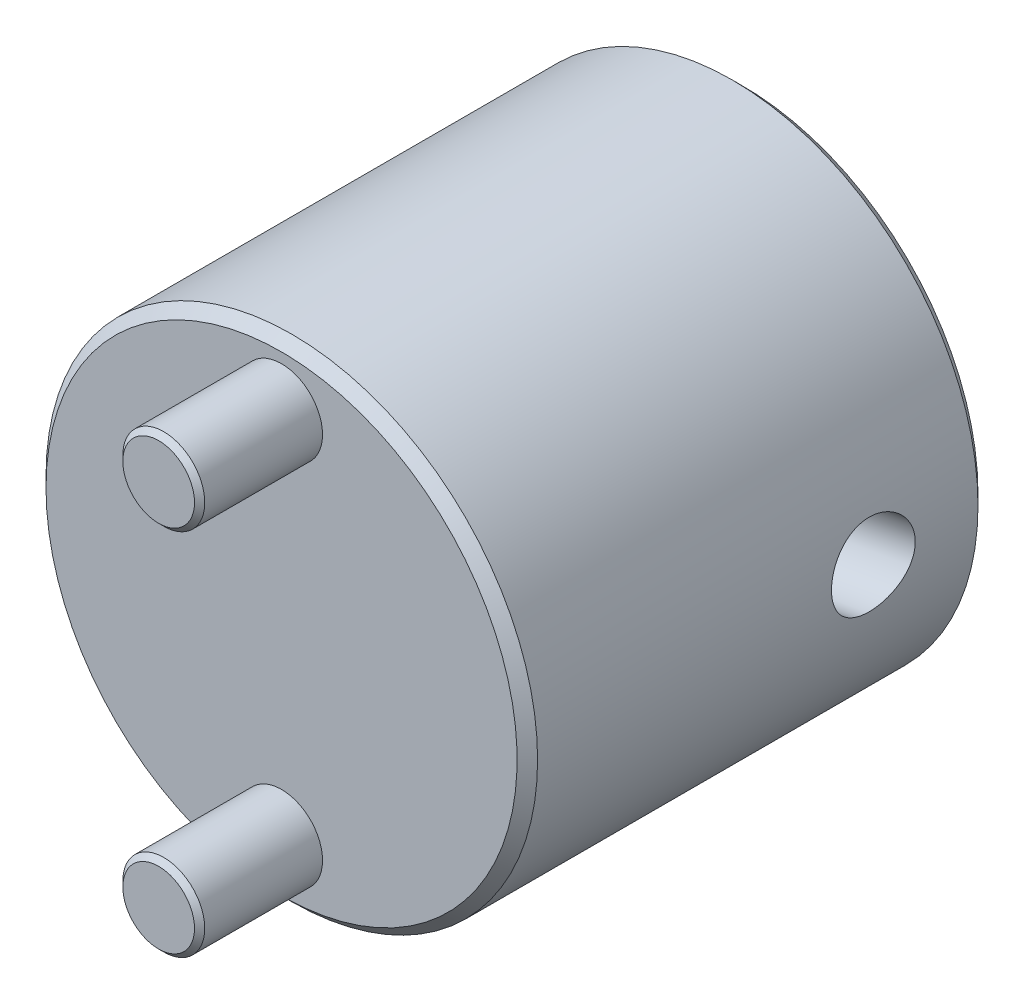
ISO-10303-21;
HEADER;
FILE_DESCRIPTION(('STEP AP214'),'2;1');
FILE_NAME('part.step','',(''),(''),'','','');
FILE_SCHEMA(('AUTOMOTIVE_DESIGN { 1 0 10303 214 1 1 1 1 }'));
ENDSEC;
DATA;
#1=APPLICATION_CONTEXT('core data for automotive mechanical design processes');
#2=APPLICATION_PROTOCOL_DEFINITION('international standard','automotive_design',2000,#1);
#3=PRODUCT_CONTEXT('',#1,'mechanical');
#4=PRODUCT('Part','Part','',(#3));
#5=PRODUCT_RELATED_PRODUCT_CATEGORY('part','',(#4));
#6=PRODUCT_DEFINITION_FORMATION('','',#4);
#7=PRODUCT_DEFINITION_CONTEXT('part definition',#1,'design');
#8=PRODUCT_DEFINITION('design','',#6,#7);
#9=PRODUCT_DEFINITION_SHAPE('','',#8);
#10=(LENGTH_UNIT() NAMED_UNIT(*) SI_UNIT(.MILLI.,.METRE.));
#11=(NAMED_UNIT(*) PLANE_ANGLE_UNIT() SI_UNIT($,.RADIAN.));
#12=(NAMED_UNIT(*) SI_UNIT($,.STERADIAN.) SOLID_ANGLE_UNIT());
#13=UNCERTAINTY_MEASURE_WITH_UNIT(LENGTH_MEASURE(1.E-05),#10,'distance_accuracy_value','');
#14=(GEOMETRIC_REPRESENTATION_CONTEXT(3) GLOBAL_UNCERTAINTY_ASSIGNED_CONTEXT((#13)) GLOBAL_UNIT_ASSIGNED_CONTEXT((#10,
#11,#12)) REPRESENTATION_CONTEXT('',''));
#15=CARTESIAN_POINT('',(0.,0.,0.));
#16=DIRECTION('',(0.,0.,1.));
#17=DIRECTION('',(1.,0.,0.));
#18=AXIS2_PLACEMENT_3D('',#15,#16,#17);
#19=CARTESIAN_POINT('',(0.,0.,12.));
#20=DIRECTION('',(0.,0.,1.));
#21=DIRECTION('',(1.,0.,0.));
#22=AXIS2_PLACEMENT_3D('',#19,#20,#21);
#23=PLANE('',#22);
#24=CARTESIAN_POINT('',(0.,18.,12.));
#25=DIRECTION('',(0.,0.,1.));
#26=DIRECTION('',(1.,0.,0.));
#27=AXIS2_PLACEMENT_3D('',#24,#25,#26);
#28=CIRCLE('',#27,3.50000030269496);
#29=CARTESIAN_POINT('',(3.50000030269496,18.,12.));
#30=VERTEX_POINT('',#29);
#31=EDGE_CURVE('E17',#30,#30,#28,.F.);
#32=ORIENTED_EDGE('',*,*,#31,.F.);
#33=EDGE_LOOP('',(#32));
#34=FACE_BOUND('',#33,.T.);
#35=ADVANCED_FACE('F14',(#34),#23,.T.);
#36=CARTESIAN_POINT('',(0.,0.,12.));
#37=DIRECTION('',(0.,0.,1.));
#38=DIRECTION('',(1.,0.,0.));
#39=AXIS2_PLACEMENT_3D('',#36,#37,#38);
#40=PLANE('',#39);
#41=CARTESIAN_POINT('',(0.,-18.,12.));
#42=DIRECTION('',(0.,0.,1.));
#43=DIRECTION('',(1.,0.,0.));
#44=AXIS2_PLACEMENT_3D('',#41,#42,#43);
#45=CIRCLE('',#44,3.50000030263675);
#46=CARTESIAN_POINT('',(3.50000030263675,-18.,12.));
#47=VERTEX_POINT('',#46);
#48=EDGE_CURVE('E121',#47,#47,#45,.F.);
#49=ORIENTED_EDGE('',*,*,#48,.F.);
#50=EDGE_LOOP('',(#49));
#51=FACE_BOUND('',#50,.T.);
#52=ADVANCED_FACE('F111',(#51),#40,.T.);
#53=CARTESIAN_POINT('',(2.796688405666,0.,-8.319464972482));
#54=DIRECTION('',(0.207911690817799,0.,0.978147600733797));
#55=DIRECTION('',(0.978147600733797,0.,-0.207911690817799));
#56=AXIS2_PLACEMENT_3D('',#53,#54,#55);
#57=PLANE('',#56);
#58=CARTESIAN_POINT('',(2.7966884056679,0.,-8.31946497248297));
#59=DIRECTION('',(0.207911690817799,0.,0.978147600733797));
#60=DIRECTION('',(0.978147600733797,0.,-0.207911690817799));
#61=AXIS2_PLACEMENT_3D('',#58,#59,#60);
#62=CIRCLE('',#61,12.5);
#63=CARTESIAN_POINT('',(15.0235334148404,0.,-10.9183611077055));
#64=VERTEX_POINT('',#63);
#65=EDGE_CURVE('E36',#64,#64,#62,.F.);
#66=ORIENTED_EDGE('',*,*,#65,.T.);
#67=EDGE_LOOP('',(#66));
#68=FACE_BOUND('',#67,.T.);
#69=ADVANCED_FACE('F108',(#68),#57,.F.);
#70=CARTESIAN_POINT('',(0.,18.,11.4999988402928));
#71=DIRECTION('',(0.,0.,-1.));
#72=DIRECTION('',(-1.,0.,0.));
#73=AXIS2_PLACEMENT_3D('',#70,#71,#72);
#74=CONICAL_SURFACE('',#73,4.00000150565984,0.785398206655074);
#75=CARTESIAN_POINT('',(0.,18.,11.49999733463));
#76=DIRECTION('',(0.,0.,1.));
#77=DIRECTION('',(1.,0.,0.));
#78=AXIS2_PLACEMENT_3D('',#75,#76,#77);
#79=CIRCLE('',#78,4.);
#80=CARTESIAN_POINT('',(4.,18.,11.49999733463));
#81=VERTEX_POINT('',#80);
#82=EDGE_CURVE('E33',#81,#81,#79,.F.);
#83=ORIENTED_EDGE('',*,*,#82,.F.);
#84=EDGE_LOOP('',(#83));
#85=FACE_BOUND('',#84,.T.);
#86=ORIENTED_EDGE('',*,*,#31,.T.);
#87=EDGE_LOOP('',(#86));
#88=FACE_BOUND('',#87,.T.);
#89=ADVANCED_FACE('F104',(#85,#88),#74,.T.);
#90=CARTESIAN_POINT('',(0.,-18.,11.4999988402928));
#91=DIRECTION('',(0.,0.,-1.));
#92=DIRECTION('',(-1.,0.,0.));
#93=AXIS2_PLACEMENT_3D('',#90,#91,#92);
#94=CONICAL_SURFACE('',#93,4.00000150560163,0.785398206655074);
#95=CARTESIAN_POINT('',(0.,-18.,11.49999733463));
#96=DIRECTION('',(0.,0.,1.));
#97=DIRECTION('',(1.,0.,0.));
#98=AXIS2_PLACEMENT_3D('',#95,#96,#97);
#99=CIRCLE('',#98,4.);
#100=CARTESIAN_POINT('',(4.,-18.,11.49999733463));
#101=VERTEX_POINT('',#100);
#102=EDGE_CURVE('E29',#101,#101,#99,.F.);
#103=ORIENTED_EDGE('',*,*,#102,.F.);
#104=EDGE_LOOP('',(#103));
#105=FACE_BOUND('',#104,.T.);
#106=ORIENTED_EDGE('',*,*,#48,.T.);
#107=EDGE_LOOP('',(#106));
#108=FACE_BOUND('',#107,.T.);
#109=ADVANCED_FACE('F99',(#105,#108),#94,.T.);
#110=CARTESIAN_POINT('',(-8.154293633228,0.,-59.83978480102));
#111=DIRECTION('',(0.207911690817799,0.,0.978147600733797));
#112=DIRECTION('',(0.978147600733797,0.,-0.207911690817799));
#113=AXIS2_PLACEMENT_3D('',#110,#111,#112);
#114=CYLINDRICAL_SURFACE('',#113,12.5);
#115=CARTESIAN_POINT('',(-4.9999999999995,0.,-45.));
#116=DIRECTION('',(0.,0.,-1.));
#117=DIRECTION('',(1.,0.,0.));
#118=AXIS2_PLACEMENT_3D('',#115,#116,#117);
#119=ELLIPSE('',#118,12.779257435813,12.5);
#120=CARTESIAN_POINT('',(7.77925743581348,0.,-45.));
#121=VERTEX_POINT('',#120);
#122=EDGE_CURVE('E32',#121,#121,#119,.F.);
#123=ORIENTED_EDGE('',*,*,#122,.F.);
#124=EDGE_LOOP('',(#123));
#125=FACE_BOUND('',#124,.T.);
#126=ORIENTED_EDGE('',*,*,#65,.F.);
#127=EDGE_LOOP('',(#126));
#128=FACE_BOUND('',#127,.T.);
#129=CARTESIAN_POINT('',(9.92969698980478,0.,-34.8829773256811));
#130=CARTESIAN_POINT('',(9.92969690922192,0.109267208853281,-34.8829771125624));
#131=CARTESIAN_POINT('',(9.92922387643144,0.21853734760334,-34.8782954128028));
#132=CARTESIAN_POINT('',(9.92736131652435,0.436308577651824,-34.8596159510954));
#133=CARTESIAN_POINT('',(9.92597143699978,0.544809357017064,-34.8456146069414));
#134=CARTESIAN_POINT('',(9.92235994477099,0.760358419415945,-34.8084095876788));
#135=CARTESIAN_POINT('',(9.92013725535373,0.86740463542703,-34.7851939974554));
#136=CARTESIAN_POINT('',(9.9150067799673,1.07914970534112,-34.7298047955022));
#137=CARTESIAN_POINT('',(9.91209872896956,1.18384763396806,-34.6976277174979));
#138=CARTESIAN_POINT('',(9.90264013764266,1.49277788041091,-34.5882675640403));
#139=CARTESIAN_POINT('',(9.89534102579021,1.69256281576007,-34.4981300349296));
#140=CARTESIAN_POINT('',(9.88078543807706,2.07458913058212,-34.2865883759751));
#141=CARTESIAN_POINT('',(9.87352895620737,2.25683304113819,-34.1651887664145));
#142=CARTESIAN_POINT('',(9.86139833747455,2.60472253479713,-33.8908933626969));
#143=CARTESIAN_POINT('',(9.85659987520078,2.76972880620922,-33.7371820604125));
#144=CARTESIAN_POINT('',(9.85271590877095,3.07283077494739,-33.4050774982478));
#145=CARTESIAN_POINT('',(9.85363183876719,3.21091970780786,-33.2266780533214));
#146=CARTESIAN_POINT('',(9.86431180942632,3.45978450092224,-32.8452206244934));
#147=CARTESIAN_POINT('',(9.87430614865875,3.56975347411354,-32.6416406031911));
#148=CARTESIAN_POINT('',(9.90625678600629,3.75402351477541,-32.2197999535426));
#149=CARTESIAN_POINT('',(9.92820969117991,3.82833468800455,-32.0015435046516));
#150=CARTESIAN_POINT('',(9.98491338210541,3.93682830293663,-31.5642283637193));
#151=CARTESIAN_POINT('',(10.0192407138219,3.97219740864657,-31.3454100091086));
#152=CARTESIAN_POINT('',(10.1008831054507,4.00551082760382,-30.9073735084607));
#153=CARTESIAN_POINT('',(10.1481945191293,4.00346563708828,-30.6881554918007));
#154=CARTESIAN_POINT('',(10.2520272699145,3.96293460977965,-30.2651699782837));
#155=CARTESIAN_POINT('',(10.3080824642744,3.92597140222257,-30.0611393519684));
#156=CARTESIAN_POINT('',(10.4280171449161,3.81912665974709,-29.6643226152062));
#157=CARTESIAN_POINT('',(10.4918975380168,3.74924130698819,-29.471537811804));
#158=CARTESIAN_POINT('',(10.6249382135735,3.5774893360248,-29.0988797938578));
#159=CARTESIAN_POINT('',(10.6941639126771,3.47515345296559,-28.9192469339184));
#160=CARTESIAN_POINT('',(10.8328650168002,3.2417276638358,-28.5798524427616));
#161=CARTESIAN_POINT('',(10.902340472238,3.11063158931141,-28.4200950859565));
#162=CARTESIAN_POINT('',(11.0404671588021,2.81604951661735,-28.1164255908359));
#163=CARTESIAN_POINT('',(11.1089208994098,2.65131653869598,-27.973633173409));
#164=CARTESIAN_POINT('',(11.2366389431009,2.29773509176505,-27.7161763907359));
#165=CARTESIAN_POINT('',(11.2958992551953,2.10887621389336,-27.6015242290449));
#166=CARTESIAN_POINT('',(11.3747770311,1.8105187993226,-27.4524296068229));
#167=CARTESIAN_POINT('',(11.399501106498,1.70799133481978,-27.4063695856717));
#168=CARTESIAN_POINT('',(11.4449940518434,1.49879447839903,-27.3224696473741));
#169=CARTESIAN_POINT('',(11.4657645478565,1.39212681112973,-27.2846263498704));
#170=CARTESIAN_POINT('',(11.502891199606,1.17558171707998,-27.2174964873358));
#171=CARTESIAN_POINT('',(11.5192543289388,1.0657096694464,-27.1881963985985));
#172=CARTESIAN_POINT('',(11.5472587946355,0.843458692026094,-27.1383139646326));
#173=CARTESIAN_POINT('',(11.5589022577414,0.731080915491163,-27.1177276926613));
#174=CARTESIAN_POINT('',(11.5763222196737,0.515800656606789,-27.0870197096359));
#175=CARTESIAN_POINT('',(11.5825630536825,0.413053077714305,-27.0760680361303));
#176=CARTESIAN_POINT('',(11.5908972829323,0.206871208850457,-27.0614563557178));
#177=CARTESIAN_POINT('',(11.5929906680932,0.103436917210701,-27.0577963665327));
#178=CARTESIAN_POINT('',(11.5929903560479,-0.109267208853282,-27.0577966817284));
#179=CARTESIAN_POINT('',(11.5906540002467,-0.21853734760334,-27.0618812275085));
#180=CARTESIAN_POINT('',(11.5813548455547,-0.436308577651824,-27.0781881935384));
#181=CARTESIAN_POINT('',(11.5743902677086,-0.544809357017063,-27.0904137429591));
#182=CARTESIAN_POINT('',(11.5559583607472,-0.760358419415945,-27.1229332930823));
#183=CARTESIAN_POINT('',(11.5444852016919,-0.867404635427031,-27.1432377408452));
#184=CARTESIAN_POINT('',(11.5172694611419,-1.07914970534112,-27.1917515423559));
#185=CARTESIAN_POINT('',(11.5015252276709,-1.18384763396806,-27.2199639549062));
#186=CARTESIAN_POINT('',(11.4484035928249,-1.4927778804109,-27.31602227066));
#187=CARTESIAN_POINT('',(11.4050732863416,-1.69256281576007,-27.3953981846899));
#188=CARTESIAN_POINT('',(11.3057343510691,-2.07458913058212,-27.5827308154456));
#189=CARTESIAN_POINT('',(11.2497275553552,-2.25683304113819,-27.690683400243));
#190=CARTESIAN_POINT('',(11.1270796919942,-2.60472253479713,-27.9363307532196));
#191=CARTESIAN_POINT('',(11.0601760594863,-2.76972880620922,-28.0748013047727));
#192=CARTESIAN_POINT('',(10.9215487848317,-3.07283077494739,-28.3766141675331));
#193=CARTESIAN_POINT('',(10.8498239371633,-3.21091970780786,-28.5399627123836));
#194=CARTESIAN_POINT('',(10.7044278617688,-3.45978450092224,-28.8927853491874));
#195=CARTESIAN_POINT('',(10.630754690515,-3.56975347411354,-29.0828300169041));
#196=CARTESIAN_POINT('',(10.4883650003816,-3.75402351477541,-29.4811961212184));
#197=CARTESIAN_POINT('',(10.4196470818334,-3.82833468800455,-29.68951235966));
#198=CARTESIAN_POINT('',(10.293576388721,-3.93682830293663,-30.112083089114));
#199=CARTESIAN_POINT('',(10.2359345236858,-3.97219740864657,-30.3259457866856));
#200=CARTESIAN_POINT('',(10.1323530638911,-4.00551082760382,-30.759318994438));
#201=CARTESIAN_POINT('',(10.0864101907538,-4.00346563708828,-30.9788279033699));
#202=CARTESIAN_POINT('',(10.0092224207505,-3.96293460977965,-31.4074769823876));
#203=CARTESIAN_POINT('',(9.97744465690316,-3.92597140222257,-31.6166679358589));
#204=CARTESIAN_POINT('',(9.92561053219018,-3.81912665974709,-32.0279598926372));
#205=CARTESIAN_POINT('',(9.90555553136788,-3.74924130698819,-32.2300600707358));
#206=CARTESIAN_POINT('',(9.87552056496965,-3.5774893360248,-32.6246126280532));
#207=CARTESIAN_POINT('',(9.86569812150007,-3.47515345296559,-32.8168720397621));
#208=CARTESIAN_POINT('',(9.85436370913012,-3.2417276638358,-33.1833391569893));
#209=CARTESIAN_POINT('',(9.85285352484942,-3.11063158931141,-33.3575429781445));
#210=CARTESIAN_POINT('',(9.85552502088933,-2.81604951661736,-33.6911400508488));
#211=CARTESIAN_POINT('',(9.85998171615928,-2.65131653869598,-33.8494300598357));
#212=CARTESIAN_POINT('',(9.87194084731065,-2.29773509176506,-34.1365761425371));
#213=CARTESIAN_POINT('',(9.87944460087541,-2.10887621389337,-34.2654194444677));
#214=CARTESIAN_POINT('',(9.89086078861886,-1.81051879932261,-34.4337066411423));
#215=CARTESIAN_POINT('',(9.89471305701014,-1.70799133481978,-34.4858407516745));
#216=CARTESIAN_POINT('',(9.90214775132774,-1.49879447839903,-34.5809908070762));
#217=CARTESIAN_POINT('',(9.90573028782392,-1.39212681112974,-34.6240105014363));
#218=CARTESIAN_POINT('',(9.91234299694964,-1.17558171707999,-34.7004374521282));
#219=CARTESIAN_POINT('',(9.91537403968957,-1.06570966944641,-34.7338598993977));
#220=CARTESIAN_POINT('',(9.92066837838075,-0.843458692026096,-34.790820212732));
#221=CARTESIAN_POINT('',(9.92293202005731,-0.731080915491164,-34.8143625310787));
#222=CARTESIAN_POINT('',(9.92635588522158,-0.51580065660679,-34.8495010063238));
#223=CARTESIAN_POINT('',(9.92760272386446,-0.413053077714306,-34.8620442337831));
#224=CARTESIAN_POINT('',(9.92927331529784,-0.206871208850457,-34.8787825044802));
#225=CARTESIAN_POINT('',(9.92969706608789,-0.103436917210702,-34.8829775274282));
#226=CARTESIAN_POINT('',(9.92969698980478,0.,-34.8829773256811));
#227=B_SPLINE_CURVE_WITH_KNOTS('',3,(#129,#130,#131,#132,#133,#134,#135,#136,#137,#138,#139,
#140,#141,#142,#143,#144,#145,#146,#147,#148,#149,#150,#151,#152,#153,#154,#155,#156,#157,#158,
#159,#160,#161,#162,#163,#164,#165,#166,#167,#168,#169,#170,#171,#172,#173,#174,#175,#176,#177,
#178,#179,#180,#181,#182,#183,#184,#185,#186,#187,#188,#189,#190,#191,#192,#193,#194,#195,#196,
#197,#198,#199,#200,#201,#202,#203,#204,#205,#206,#207,#208,#209,#210,#211,#212,#213,#214,#215,
#216,#217,#218,#219,#220,#221,#222,#223,#224,#225,#226),.UNSPECIFIED.,.T.,.F.,(4,2,2,2,2,2,2,2,
2,2,2,2,2,2,2,2,2,2,2,2,2,2,2,2,2,2,2,2,2,2,2,2,2,2,2,2,2,2,2,2,2,2,2,2,2,2,2,2,4),(0.,
0.327705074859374,0.655536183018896,0.983792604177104,1.31217617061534,1.96678919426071,
2.62130761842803,3.29492000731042,3.96870146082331,4.66006760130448,5.35123768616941,
6.0207071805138,6.68998886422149,7.33137068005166,7.97282689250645,8.62401811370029,
9.27534913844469,9.95775723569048,10.6404607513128,10.9853574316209,11.3301119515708,
11.6743177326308,12.0183682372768,12.3285868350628,12.6388061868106,12.9665112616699,
13.2943423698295,13.6225987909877,13.9509823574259,14.6055953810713,15.2601138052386,
15.933726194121,16.6075076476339,17.298873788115,17.99004387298,18.6595133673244,
19.3287950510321,19.9701768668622,20.611633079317,21.2628243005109,21.9141553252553,
22.596563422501,23.2792669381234,23.6241636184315,23.9689181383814,24.3131239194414,
24.6571744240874,24.9673930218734,25.2776123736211),.UNSPECIFIED.);
#228=CARTESIAN_POINT('',(9.92969698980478,0.,-34.8829773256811));
#229=VERTEX_POINT('',#228);
#230=EDGE_CURVE('E84',#229,#229,#227,.T.);
#231=ORIENTED_EDGE('',*,*,#230,.T.);
#232=EDGE_LOOP('',(#231));
#233=FACE_BOUND('',#232,.T.);
#234=ADVANCED_FACE('F93',(#125,#128,#233),#114,.F.);
#235=CARTESIAN_POINT('',(0.,18.,0.));
#236=DIRECTION('',(0.,0.,1.));
#237=DIRECTION('',(1.,0.,0.));
#238=AXIS2_PLACEMENT_3D('',#235,#236,#237);
#239=CYLINDRICAL_SURFACE('',#238,4.);
#240=CARTESIAN_POINT('',(0.,18.,0.));
#241=DIRECTION('',(0.,0.,1.));
#242=DIRECTION('',(1.,0.,0.));
#243=AXIS2_PLACEMENT_3D('',#240,#241,#242);
#244=CIRCLE('',#243,4.);
#245=CARTESIAN_POINT('',(4.,18.,0.));
#246=VERTEX_POINT('',#245);
#247=EDGE_CURVE('E80',#246,#246,#244,.T.);
#248=ORIENTED_EDGE('',*,*,#247,.T.);
#249=EDGE_LOOP('',(#248));
#250=FACE_BOUND('',#249,.T.);
#251=ORIENTED_EDGE('',*,*,#82,.T.);
#252=EDGE_LOOP('',(#251));
#253=FACE_BOUND('',#252,.T.);
#254=ADVANCED_FACE('F98',(#250,#253),#239,.T.);
#255=CARTESIAN_POINT('',(0.,-18.,0.));
#256=DIRECTION('',(0.,0.,1.));
#257=DIRECTION('',(1.,0.,0.));
#258=AXIS2_PLACEMENT_3D('',#255,#256,#257);
#259=CYLINDRICAL_SURFACE('',#258,4.);
#260=CARTESIAN_POINT('',(0.,-18.,0.));
#261=DIRECTION('',(0.,0.,1.));
#262=DIRECTION('',(1.,0.,0.));
#263=AXIS2_PLACEMENT_3D('',#260,#261,#262);
#264=CIRCLE('',#263,4.);
#265=CARTESIAN_POINT('',(4.,-18.,0.));
#266=VERTEX_POINT('',#265);
#267=EDGE_CURVE('E76',#266,#266,#264,.T.);
#268=ORIENTED_EDGE('',*,*,#267,.T.);
#269=EDGE_LOOP('',(#268));
#270=FACE_BOUND('',#269,.T.);
#271=ORIENTED_EDGE('',*,*,#102,.T.);
#272=EDGE_LOOP('',(#271));
#273=FACE_BOUND('',#272,.T.);
#274=ADVANCED_FACE('F178',(#270,#273),#259,.T.);
#275=CARTESIAN_POINT('',(0.,0.,-45.));
#276=DIRECTION('',(0.,0.,-1.));
#277=DIRECTION('',(-1.,0.,0.));
#278=AXIS2_PLACEMENT_3D('',#275,#276,#277);
#279=PLANE('',#278);
#280=ORIENTED_EDGE('',*,*,#122,.T.);
#281=EDGE_LOOP('',(#280));
#282=FACE_BOUND('',#281,.T.);
#283=CARTESIAN_POINT('',(0.,0.,-44.9999998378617));
#284=DIRECTION('',(0.,0.,1.));
#285=DIRECTION('',(1.,0.,0.));
#286=AXIS2_PLACEMENT_3D('',#283,#284,#285);
#287=CIRCLE('',#286,22.9999993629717);
#288=CARTESIAN_POINT('',(22.9999993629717,0.,-44.9999998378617));
#289=VERTEX_POINT('',#288);
#290=EDGE_CURVE('E46',#289,#289,#287,.T.);
#291=ORIENTED_EDGE('',*,*,#290,.F.);
#292=EDGE_LOOP('',(#291));
#293=FACE_BOUND('',#292,.T.);
#294=ADVANCED_FACE('F71',(#282,#293),#279,.T.);
#295=CARTESIAN_POINT('',(-7.057114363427,0.,-27.18295673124));
#296=DIRECTION('',(0.978147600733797,0.,-0.207911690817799));
#297=DIRECTION('',(-0.207911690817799,0.,-0.978147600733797));
#298=AXIS2_PLACEMENT_3D('',#295,#296,#297);
#299=CYLINDRICAL_SURFACE('',#298,4.);
#300=ORIENTED_EDGE('',*,*,#230,.F.);
#301=EDGE_LOOP('',(#300));
#302=FACE_BOUND('',#301,.T.);
#303=CARTESIAN_POINT('',(24.,0.,-29.6949877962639));
#304=CARTESIAN_POINT('',(23.9999955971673,0.224172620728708,-29.6949972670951));
#305=CARTESIAN_POINT('',(23.9968244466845,0.448613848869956,-29.7136541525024));
#306=CARTESIAN_POINT('',(23.9844663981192,0.891434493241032,-29.7879014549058));
#307=CARTESIAN_POINT('',(23.9752678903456,1.10980136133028,-29.8435631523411));
#308=CARTESIAN_POINT('',(23.951876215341,1.53384345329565,-29.9903946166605));
#309=CARTESIAN_POINT('',(23.9376864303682,1.73952716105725,-30.0815403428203));
#310=CARTESIAN_POINT('',(23.9058966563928,2.13236609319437,-30.2969119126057));
#311=CARTESIAN_POINT('',(23.8882981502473,2.3195293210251,-30.4211233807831));
#312=CARTESIAN_POINT('',(23.8516889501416,2.66982249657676,-30.6990939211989));
#313=CARTESIAN_POINT('',(23.8326804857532,2.8329892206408,-30.8528069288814));
#314=CARTESIAN_POINT('',(23.795364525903,3.13101350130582,-31.1856689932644));
#315=CARTESIAN_POINT('',(23.7770570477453,3.26587035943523,-31.3648186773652));
#316=CARTESIAN_POINT('',(23.7432591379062,3.50314355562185,-31.7428106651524));
#317=CARTESIAN_POINT('',(23.7277592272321,3.60566995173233,-31.9415830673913));
#318=CARTESIAN_POINT('',(23.7012005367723,3.77632001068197,-32.3536415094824));
#319=CARTESIAN_POINT('',(23.6901417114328,3.84444402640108,-32.5669274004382));
#320=CARTESIAN_POINT('',(23.6735822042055,3.94514243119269,-33.0030775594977));
#321=CARTESIAN_POINT('',(23.6681104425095,3.9775319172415,-33.2259855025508));
#322=CARTESIAN_POINT('',(23.6633290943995,4.0058778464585,-33.6741585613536));
#323=CARTESIAN_POINT('',(23.6640202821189,4.00182971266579,-33.8994239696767));
#324=CARTESIAN_POINT('',(23.6714756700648,3.95749331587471,-34.3517650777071));
#325=CARTESIAN_POINT('',(23.6783868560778,3.91632788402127,-34.5787520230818));
#326=CARTESIAN_POINT('',(23.6976332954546,3.79812054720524,-35.0229632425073));
#327=CARTESIAN_POINT('',(23.7099697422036,3.72107074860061,-35.2401853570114));
#328=CARTESIAN_POINT('',(23.7391453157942,3.53023872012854,-35.6660494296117));
#329=CARTESIAN_POINT('',(23.7561176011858,3.41534534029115,-35.8741840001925));
#330=CARTESIAN_POINT('',(23.7924282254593,3.15243889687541,-36.2683385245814));
#331=CARTESIAN_POINT('',(23.8117666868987,3.00442411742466,-36.4543573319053));
#332=CARTESIAN_POINT('',(23.8409147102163,2.75999737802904,-36.7128521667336));
#333=CARTESIAN_POINT('',(23.8506879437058,2.67445463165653,-36.7958443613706));
#334=CARTESIAN_POINT('',(23.8699737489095,2.49646865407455,-36.9540769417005));
#335=CARTESIAN_POINT('',(23.8794864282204,2.40402833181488,-37.0293205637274));
#336=CARTESIAN_POINT('',(23.8979686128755,2.21276598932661,-37.1714281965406));
#337=CARTESIAN_POINT('',(23.9069377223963,2.11393942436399,-37.2382861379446));
#338=CARTESIAN_POINT('',(23.9240401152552,1.91067970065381,-37.3628797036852));
#339=CARTESIAN_POINT('',(23.9321737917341,1.80624921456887,-37.4206196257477));
#340=CARTESIAN_POINT('',(23.9470349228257,1.59689524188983,-37.5242244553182));
#341=CARTESIAN_POINT('',(23.9538063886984,1.49216786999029,-37.5704794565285));
#342=CARTESIAN_POINT('',(23.9661322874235,1.27901911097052,-37.653562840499));
#343=CARTESIAN_POINT('',(23.9716872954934,1.17059949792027,-37.6903956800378));
#344=CARTESIAN_POINT('',(23.9813987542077,0.951083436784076,-37.7541821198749));
#345=CARTESIAN_POINT('',(23.9855581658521,0.839993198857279,-37.781156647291));
#346=CARTESIAN_POINT('',(23.9923590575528,0.615842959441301,-37.8250089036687));
#347=CARTESIAN_POINT('',(23.9950014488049,0.502784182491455,-37.8418926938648));
#348=CARTESIAN_POINT('',(23.9978924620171,0.32457031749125,-37.8603212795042));
#349=CARTESIAN_POINT('',(23.9986819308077,0.259764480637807,-37.8653407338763));
#350=CARTESIAN_POINT('',(23.9997357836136,0.129975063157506,-37.8720366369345));
#351=CARTESIAN_POINT('',(24.0000001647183,0.0649914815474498,-37.8737130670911));
#352=CARTESIAN_POINT('',(23.9999997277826,-0.107406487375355,-37.8737117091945));
#353=CARTESIAN_POINT('',(23.9992769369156,-0.214834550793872,-37.8691308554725));
#354=CARTESIAN_POINT('',(23.9964057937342,-0.428934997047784,-37.8508524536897));
#355=CARTESIAN_POINT('',(23.9942567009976,-0.535606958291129,-37.8371501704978));
#356=CARTESIAN_POINT('',(23.9885889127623,-0.747563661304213,-37.8007362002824));
#357=CARTESIAN_POINT('',(23.9850678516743,-0.852845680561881,-37.7780089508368));
#358=CARTESIAN_POINT('',(23.9767591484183,-1.06109027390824,-37.7237918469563));
#359=CARTESIAN_POINT('',(23.9719710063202,-1.16405191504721,-37.6922985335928));
#360=CARTESIAN_POINT('',(23.9559288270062,-1.46775913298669,-37.5853147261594));
#361=CARTESIAN_POINT('',(23.9429743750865,-1.66411833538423,-37.4971821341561));
#362=CARTESIAN_POINT('',(23.9139221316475,-2.0395901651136,-37.2905366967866));
#363=CARTESIAN_POINT('',(23.8978252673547,-2.21870785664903,-37.1720328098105));
#364=CARTESIAN_POINT('',(23.8635309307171,-2.56176160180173,-36.9038536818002));
#365=CARTESIAN_POINT('',(23.8452802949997,-2.72496480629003,-36.7532475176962));
#366=CARTESIAN_POINT('',(23.8090304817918,-3.02539730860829,-36.4280021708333));
#367=CARTESIAN_POINT('',(23.7910313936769,-3.16261758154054,-36.2533546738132));
#368=CARTESIAN_POINT('',(23.7561304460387,-3.41518260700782,-35.874132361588));
#369=CARTESIAN_POINT('',(23.7393491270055,-3.52884035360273,-35.6684206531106));
#370=CARTESIAN_POINT('',(23.709978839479,-3.721075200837,-35.2409076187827));
#371=CARTESIAN_POINT('',(23.6973905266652,-3.79964681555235,-35.0191037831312));
#372=CARTESIAN_POINT('',(23.6776841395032,-3.92060601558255,-34.5606879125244));
#373=CARTESIAN_POINT('',(23.6706832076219,-3.96222070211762,-34.3238657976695));
#374=CARTESIAN_POINT('',(23.6635371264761,-4.00468493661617,-33.846479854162));
#375=CARTESIAN_POINT('',(23.6633910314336,-4.00554010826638,-33.6059165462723));
#376=CARTESIAN_POINT('',(23.6700230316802,-3.96615445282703,-33.1336809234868));
#377=CARTESIAN_POINT('',(23.6766461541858,-3.926833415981,-32.9019301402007));
#378=CARTESIAN_POINT('',(23.6958919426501,-3.80896870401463,-32.4488855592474));
#379=CARTESIAN_POINT('',(23.7085135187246,-3.73043215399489,-32.2275898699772));
#380=CARTESIAN_POINT('',(23.7378029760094,-3.53916656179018,-31.8092034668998));
#381=CARTESIAN_POINT('',(23.7543282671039,-3.42761358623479,-31.6115644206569));
#382=CARTESIAN_POINT('',(23.7897354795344,-3.17253812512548,-31.2383850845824));
#383=CARTESIAN_POINT('',(23.8086170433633,-3.02902048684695,-31.0628414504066));
#384=CARTESIAN_POINT('',(23.8462975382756,-2.71633615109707,-30.7411939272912));
#385=CARTESIAN_POINT('',(23.8650938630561,-2.54756079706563,-30.5947088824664));
#386=CARTESIAN_POINT('',(23.9007767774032,-2.18758459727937,-30.3320392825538));
#387=CARTESIAN_POINT('',(23.9176625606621,-1.99637435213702,-30.2158674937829));
#388=CARTESIAN_POINT('',(23.9476703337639,-1.59666155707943,-30.016790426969));
#389=CARTESIAN_POINT('',(23.9607849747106,-1.3881262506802,-29.933949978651));
#390=CARTESIAN_POINT('',(23.9817353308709,-0.960223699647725,-29.8041163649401));
#391=CARTESIAN_POINT('',(23.9895810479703,-0.740877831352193,-29.7570552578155));
#392=CARTESIAN_POINT('',(23.996245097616,-0.433259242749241,-29.717275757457));
#393=CARTESIAN_POINT('',(23.9976499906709,-0.3468360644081,-29.7089239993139));
#394=CARTESIAN_POINT('',(23.999528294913,-0.173622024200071,-29.6977781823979));
#395=CARTESIAN_POINT('',(24.0000017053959,-0.0868311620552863,-29.6949841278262));
#396=CARTESIAN_POINT('',(24.,0.,-29.6949877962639));
#397=B_SPLINE_CURVE_WITH_KNOTS('',3,(#303,#304,#305,#306,#307,#308,#309,#310,#311,#312,#313,
#314,#315,#316,#317,#318,#319,#320,#321,#322,#323,#324,#325,#326,#327,#328,#329,#330,#331,#332,
#333,#334,#335,#336,#337,#338,#339,#340,#341,#342,#343,#344,#345,#346,#347,#348,#349,#350,#351,
#352,#353,#354,#355,#356,#357,#358,#359,#360,#361,#362,#363,#364,#365,#366,#367,#368,#369,#370,
#371,#372,#373,#374,#375,#376,#377,#378,#379,#380,#381,#382,#383,#384,#385,#386,#387,#388,#389,
#390,#391,#392,#393,#394,#395,#396),.UNSPECIFIED.,.T.,.F.,(4,2,2,2,2,2,2,2,2,2,2,2,2,2,2,2,2,2,
2,2,2,2,2,2,2,2,2,2,2,2,2,2,2,2,2,2,2,2,2,2,2,2,2,2,2,2,4),(0.,0.672191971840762,
1.34568251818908,2.01871756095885,2.69146047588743,3.36316137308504,4.03487884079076,
4.70428435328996,5.37368299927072,6.04652933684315,6.71946019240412,7.40872318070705,
8.09813786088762,8.80993091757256,9.52176085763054,9.88014814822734,10.2383851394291,
10.5968799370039,10.9552052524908,11.2988252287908,11.6422823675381,11.9850061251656,
12.3275238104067,12.5224590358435,12.7173953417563,13.0395517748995,13.3618755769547,
13.6847576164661,14.0077672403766,14.6514060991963,15.2948553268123,15.9604073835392,
16.6261901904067,17.3298209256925,18.0335616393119,18.751695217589,19.4697297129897,
20.1716860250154,20.8735148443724,21.5528585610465,22.2320993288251,22.9017362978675,
23.5716548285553,24.2428701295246,24.9128076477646,25.1731747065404,25.4335419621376),.UNSPECIFIED.);
#398=CARTESIAN_POINT('',(24.,0.,-29.6949877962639));
#399=VERTEX_POINT('',#398);
#400=EDGE_CURVE('E39',#399,#399,#397,.T.);
#401=ORIENTED_EDGE('',*,*,#400,.F.);
#402=EDGE_LOOP('',(#401));
#403=FACE_BOUND('',#402,.T.);
#404=ADVANCED_FACE('F48',(#302,#403),#299,.F.);
#405=CARTESIAN_POINT('',(0.,0.,0.));
#406=DIRECTION('',(0.,0.,-1.));
#407=DIRECTION('',(-1.,0.,0.));
#408=AXIS2_PLACEMENT_3D('',#405,#406,#407);
#409=PLANE('',#408);
#410=ORIENTED_EDGE('',*,*,#267,.F.);
#411=EDGE_LOOP('',(#410));
#412=FACE_BOUND('',#411,.T.);
#413=ORIENTED_EDGE('',*,*,#247,.F.);
#414=EDGE_LOOP('',(#413));
#415=FACE_BOUND('',#414,.T.);
#416=CARTESIAN_POINT('',(0.,0.,-5.53115227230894E-08));
#417=DIRECTION('',(0.,0.,-1.));
#418=DIRECTION('',(-1.,0.,0.));
#419=AXIS2_PLACEMENT_3D('',#416,#417,#418);
#420=CIRCLE('',#419,22.9999993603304);
#421=CARTESIAN_POINT('',(-22.9999993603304,0.,-5.53115227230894E-08));
#422=VERTEX_POINT('',#421);
#423=EDGE_CURVE('E26',#422,#422,#420,.T.);
#424=ORIENTED_EDGE('',*,*,#423,.F.);
#425=EDGE_LOOP('',(#424));
#426=FACE_BOUND('',#425,.T.);
#427=ADVANCED_FACE('F63',(#412,#415,#426),#409,.F.);
#428=CARTESIAN_POINT('',(0.,0.,-43.9999993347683));
#429=DIRECTION('',(0.,0.,1.));
#430=DIRECTION('',(1.,0.,0.));
#431=AXIS2_PLACEMENT_3D('',#428,#429,#430);
#432=CONICAL_SURFACE('',#431,23.9999998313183,0.785398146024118);
#433=ORIENTED_EDGE('',*,*,#290,.T.);
#434=EDGE_LOOP('',(#433));
#435=FACE_BOUND('',#434,.T.);
#436=CARTESIAN_POINT('',(0.,0.,-43.99999950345));
#437=DIRECTION('',(0.,0.,-1.));
#438=DIRECTION('',(-1.,0.,0.));
#439=AXIS2_PLACEMENT_3D('',#436,#437,#438);
#440=CIRCLE('',#439,24.);
#441=CARTESIAN_POINT('',(-24.,0.,-43.99999950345));
#442=VERTEX_POINT('',#441);
#443=EDGE_CURVE('E21',#442,#442,#440,.F.);
#444=ORIENTED_EDGE('',*,*,#443,.F.);
#445=EDGE_LOOP('',(#444));
#446=FACE_BOUND('',#445,.T.);
#447=ADVANCED_FACE('F60',(#435,#446),#432,.T.);
#448=CARTESIAN_POINT('',(0.,0.,-1.00000066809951));
#449=DIRECTION('',(0.,0.,-1.));
#450=DIRECTION('',(-1.,0.,0.));
#451=AXIS2_PLACEMENT_3D('',#448,#449,#450);
#452=CONICAL_SURFACE('',#451,23.9999999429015,0.785398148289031);
#453=CARTESIAN_POINT('',(0.,0.,-1.000000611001));
#454=DIRECTION('',(0.,0.,-1.));
#455=DIRECTION('',(-1.,0.,0.));
#456=AXIS2_PLACEMENT_3D('',#453,#454,#455);
#457=CIRCLE('',#456,24.);
#458=CARTESIAN_POINT('',(-24.,0.,-1.000000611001));
#459=VERTEX_POINT('',#458);
#460=EDGE_CURVE('E9',#459,#459,#457,.T.);
#461=ORIENTED_EDGE('',*,*,#460,.F.);
#462=EDGE_LOOP('',(#461));
#463=FACE_BOUND('',#462,.T.);
#464=ORIENTED_EDGE('',*,*,#423,.T.);
#465=EDGE_LOOP('',(#464));
#466=FACE_BOUND('',#465,.T.);
#467=ADVANCED_FACE('F56',(#463,#466),#452,.T.);
#468=CARTESIAN_POINT('',(0.,0.,2.25));
#469=DIRECTION('',(0.,0.,-1.));
#470=DIRECTION('',(-1.,0.,0.));
#471=AXIS2_PLACEMENT_3D('',#468,#469,#470);
#472=CYLINDRICAL_SURFACE('',#471,24.);
#473=ORIENTED_EDGE('',*,*,#443,.T.);
#474=EDGE_LOOP('',(#473));
#475=FACE_BOUND('',#474,.T.);
#476=ORIENTED_EDGE('',*,*,#460,.T.);
#477=EDGE_LOOP('',(#476));
#478=FACE_BOUND('',#477,.T.);
#479=ORIENTED_EDGE('',*,*,#400,.T.);
#480=EDGE_LOOP('',(#479));
#481=FACE_BOUND('',#480,.T.);
#482=ADVANCED_FACE('F52',(#475,#478,#481),#472,.T.);
#483=CLOSED_SHELL('',(#35,#52,#69,#89,#109,#234,#254,#274,#294,#404,#427,#447,#467,#482));
#484=MANIFOLD_SOLID_BREP('B1',#483);
#485=ADVANCED_BREP_SHAPE_REPRESENTATION('',(#18,#484),#14);
#486=SHAPE_DEFINITION_REPRESENTATION(#9,#485);
ENDSEC;
END-ISO-10303-21;
